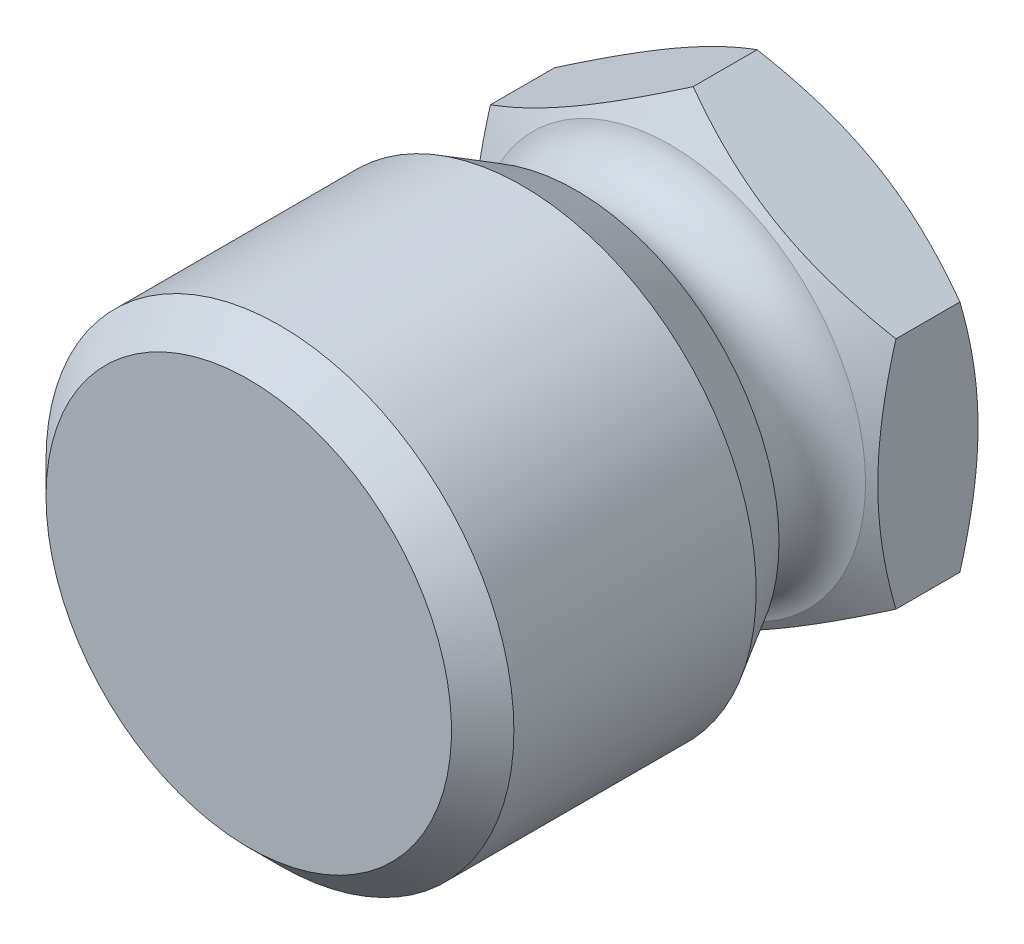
ISO-10303-21;
HEADER;
FILE_DESCRIPTION(('STEP AP214'),'2;1');
FILE_NAME('part.step','',(''),(''),'','','');
FILE_SCHEMA(('AUTOMOTIVE_DESIGN { 1 0 10303 214 1 1 1 1 }'));
ENDSEC;
DATA;
#1=APPLICATION_CONTEXT('core data for automotive mechanical design processes');
#2=APPLICATION_PROTOCOL_DEFINITION('international standard','automotive_design',2000,#1);
#3=PRODUCT_CONTEXT('',#1,'mechanical');
#4=PRODUCT('Part','Part','',(#3));
#5=PRODUCT_RELATED_PRODUCT_CATEGORY('part','',(#4));
#6=PRODUCT_DEFINITION_FORMATION('','',#4);
#7=PRODUCT_DEFINITION_CONTEXT('part definition',#1,'design');
#8=PRODUCT_DEFINITION('design','',#6,#7);
#9=PRODUCT_DEFINITION_SHAPE('','',#8);
#10=(LENGTH_UNIT() NAMED_UNIT(*) SI_UNIT(.MILLI.,.METRE.));
#11=(NAMED_UNIT(*) PLANE_ANGLE_UNIT() SI_UNIT($,.RADIAN.));
#12=(NAMED_UNIT(*) SI_UNIT($,.STERADIAN.) SOLID_ANGLE_UNIT());
#13=UNCERTAINTY_MEASURE_WITH_UNIT(LENGTH_MEASURE(1.E-05),#10,'distance_accuracy_value','');
#14=(GEOMETRIC_REPRESENTATION_CONTEXT(3) GLOBAL_UNCERTAINTY_ASSIGNED_CONTEXT((#13)) GLOBAL_UNIT_ASSIGNED_CONTEXT((#10,
#11,#12)) REPRESENTATION_CONTEXT('',''));
#15=CARTESIAN_POINT('',(0.,0.,0.));
#16=DIRECTION('',(0.,0.,1.));
#17=DIRECTION('',(1.,0.,0.));
#18=AXIS2_PLACEMENT_3D('',#15,#16,#17);
#19=CARTESIAN_POINT('',(0.,0.,3.5));
#20=DIRECTION('',(0.,0.,-1.));
#21=DIRECTION('',(0.,-1.,0.));
#22=AXIS2_PLACEMENT_3D('',#19,#20,#21);
#23=CONICAL_SURFACE('',#22,6.25,1.0471975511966);
#24=CARTESIAN_POINT('',(0.,0.,3.5));
#25=DIRECTION('',(0.,0.,1.));
#26=DIRECTION('',(0.,-1.,0.));
#27=AXIS2_PLACEMENT_3D('',#24,#25,#26);
#28=CIRCLE('',#27,6.25);
#29=CARTESIAN_POINT('',(0.,-6.25,3.5));
#30=VERTEX_POINT('',#29);
#31=EDGE_CURVE('E236',#30,#30,#28,.T.);
#32=ORIENTED_EDGE('',*,*,#31,.F.);
#33=EDGE_LOOP('',(#32));
#34=FACE_BOUND('',#33,.T.);
#35=CARTESIAN_POINT('',(6.5002,3.75266127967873,2.77503918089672));
#36=CARTESIAN_POINT('',(6.35732254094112,3.83515161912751,2.8226580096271));
#37=CARTESIAN_POINT('',(6.21391236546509,3.91794952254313,2.86811573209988));
#38=CARTESIAN_POINT('',(5.92592736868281,4.08421773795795,2.95411375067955));
#39=CARTESIAN_POINT('',(5.78135207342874,4.16768832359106,2.99465192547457));
#40=CARTESIAN_POINT('',(5.34531134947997,4.41943655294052,3.10809143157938));
#41=CARTESIAN_POINT('',(5.05212471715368,4.5887079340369,3.17261462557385));
#42=CARTESIAN_POINT('',(4.61337625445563,4.84201947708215,3.2482758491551));
#43=CARTESIAN_POINT('',(4.46912536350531,4.92530276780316,3.2698295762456));
#44=CARTESIAN_POINT('',(4.17997178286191,5.09224566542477,3.30597211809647));
#45=CARTESIAN_POINT('',(4.03506915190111,5.17590523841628,3.32056154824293));
#46=CARTESIAN_POINT('',(3.74501222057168,5.34336968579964,3.34240368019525));
#47=CARTESIAN_POINT('',(3.59985839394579,5.427174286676,3.34966470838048));
#48=CARTESIAN_POINT('',(3.30942466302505,5.59485627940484,3.35670213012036));
#49=CARTESIAN_POINT('',(3.16414476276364,5.6787336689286,3.35647875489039));
#50=CARTESIAN_POINT('',(2.76612405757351,5.90853103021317,3.34557897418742));
#51=CARTESIAN_POINT('',(2.51351353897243,6.05437578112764,3.32728061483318));
#52=CARTESIAN_POINT('',(2.00997032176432,6.34509659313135,3.26925609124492));
#53=CARTESIAN_POINT('',(1.75903939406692,6.48997163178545,3.22951009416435));
#54=CARTESIAN_POINT('',(1.25448277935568,6.78127752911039,3.13015652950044));
#55=CARTESIAN_POINT('',(1.00092075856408,6.92767163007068,3.07012800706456));
#56=CARTESIAN_POINT('',(0.497578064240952,7.21827667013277,2.93388744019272));
#57=CARTESIAN_POINT('',(0.247790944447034,7.36249133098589,2.857707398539));
#58=CARTESIAN_POINT('',(-0.00020000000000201,7.50566896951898,2.77503918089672));
#59=B_SPLINE_CURVE_WITH_KNOTS('',3,(#35,#36,#37,#38,#39,#40,#41,#42,#43,#44,#45,#46,#47,#48,#49,
#50,#51,#52,#53,#54,#55,#56,#57,#58),.UNSPECIFIED.,.F.,.F.,(4,2,2,2,2,2,2,2,2,2,2,4),(0.,
0.515105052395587,1.03043143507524,2.06322554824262,2.56697389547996,3.07067772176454,
3.57380860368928,4.0769239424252,4.9527935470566,5.82947446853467,6.72559912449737,
7.61996451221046),.UNSPECIFIED.);
#60=CARTESIAN_POINT('',(6.5,3.75277674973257,2.77510584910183));
#61=VERTEX_POINT('',#60);
#62=CARTESIAN_POINT('',(0.,7.50555349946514,2.77510584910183));
#63=VERTEX_POINT('',#62);
#64=EDGE_CURVE('E70',#61,#63,#59,.T.);
#65=ORIENTED_EDGE('',*,*,#64,.T.);
#66=CARTESIAN_POINT('',(0.000199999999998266,7.50566896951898,2.77503918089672));
#67=CARTESIAN_POINT('',(-0.14267745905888,7.4231786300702,2.8226580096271));
#68=CARTESIAN_POINT('',(-0.286087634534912,7.34038072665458,2.86811573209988));
#69=CARTESIAN_POINT('',(-0.574072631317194,7.17411251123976,2.95411375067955));
#70=CARTESIAN_POINT('',(-0.718647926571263,7.09064192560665,2.99465192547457));
#71=CARTESIAN_POINT('',(-1.15468865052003,6.83889369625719,3.10809143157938));
#72=CARTESIAN_POINT('',(-1.44787528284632,6.66962231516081,3.17261462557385));
#73=CARTESIAN_POINT('',(-1.88662374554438,6.41631077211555,3.2482758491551));
#74=CARTESIAN_POINT('',(-2.03087463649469,6.33302748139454,3.26982957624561));
#75=CARTESIAN_POINT('',(-2.32002821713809,6.16608458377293,3.30597211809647));
#76=CARTESIAN_POINT('',(-2.46493084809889,6.08242501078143,3.32056154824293));
#77=CARTESIAN_POINT('',(-2.75498777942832,5.91496056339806,3.34240368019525));
#78=CARTESIAN_POINT('',(-2.90014160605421,5.8311559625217,3.34966470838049));
#79=CARTESIAN_POINT('',(-3.19057533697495,5.66347396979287,3.35670213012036));
#80=CARTESIAN_POINT('',(-3.33585523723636,5.5795965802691,3.35647875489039));
#81=CARTESIAN_POINT('',(-3.7338759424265,5.34979921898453,3.34557897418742));
#82=CARTESIAN_POINT('',(-3.98648646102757,5.20395446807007,3.32728061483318));
#83=CARTESIAN_POINT('',(-4.49002967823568,4.91323365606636,3.26925609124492));
#84=CARTESIAN_POINT('',(-4.74096060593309,4.76835861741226,3.22951009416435));
#85=CARTESIAN_POINT('',(-5.24551722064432,4.47705272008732,3.13015652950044));
#86=CARTESIAN_POINT('',(-5.49907924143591,4.33065861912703,3.07012800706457));
#87=CARTESIAN_POINT('',(-6.00242193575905,4.04005357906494,2.93388744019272));
#88=CARTESIAN_POINT('',(-6.25220905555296,3.89583891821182,2.857707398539));
#89=CARTESIAN_POINT('',(-6.5002,3.75266127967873,2.77503918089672));
#90=B_SPLINE_CURVE_WITH_KNOTS('',3,(#66,#67,#68,#69,#70,#71,#72,#73,#74,#75,#76,#77,#78,#79,#80,
#81,#82,#83,#84,#85,#86,#87,#88,#89),.UNSPECIFIED.,.F.,.F.,(4,2,2,2,2,2,2,2,2,2,2,4),(0.,
0.515105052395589,1.03043143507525,2.06322554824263,2.56697389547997,3.07067772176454,
3.57380860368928,4.07692394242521,4.95279354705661,5.82947446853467,6.72559912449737,
7.61996451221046),.UNSPECIFIED.);
#91=CARTESIAN_POINT('',(-6.5,3.75277674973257,2.77510584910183));
#92=VERTEX_POINT('',#91);
#93=EDGE_CURVE('E182',#63,#92,#90,.T.);
#94=ORIENTED_EDGE('',*,*,#93,.T.);
#95=CARTESIAN_POINT('',(-6.5,-10.0803059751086,0.183542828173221));
#96=CARTESIAN_POINT('',(-6.5,-9.79640798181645,0.321258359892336));
#97=CARTESIAN_POINT('',(-6.5,-9.51185826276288,0.457653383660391));
#98=CARTESIAN_POINT('',(-6.5,-8.94110879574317,0.7270597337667));
#99=CARTESIAN_POINT('',(-6.5,-8.6549087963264,0.8600705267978));
#100=CARTESIAN_POINT('',(-6.5,-8.07903757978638,1.12263491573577));
#101=CARTESIAN_POINT('',(-6.5,-7.7893559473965,1.25216574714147));
#102=CARTESIAN_POINT('',(-6.5,-7.2076885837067,1.50592640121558));
#103=CARTESIAN_POINT('',(-6.5,-6.91570296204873,1.63015647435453));
#104=CARTESIAN_POINT('',(-6.5,-6.31954132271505,1.87579840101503));
#105=CARTESIAN_POINT('',(-6.5,-6.0152748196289,1.99699184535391));
#106=CARTESIAN_POINT('',(-6.5,-5.4031817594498,2.23020600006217));
#107=CARTESIAN_POINT('',(-6.5,-5.09535480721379,2.34222568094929));
#108=CARTESIAN_POINT('',(-6.5,-4.47622849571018,2.55415186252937));
#109=CARTESIAN_POINT('',(-6.5,-4.16493761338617,2.65408288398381));
#110=CARTESIAN_POINT('',(-6.5,-3.5378872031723,2.83862388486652));
#111=CARTESIAN_POINT('',(-6.5,-3.22212911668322,2.92323868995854));
#112=CARTESIAN_POINT('',(-6.5,-2.58773233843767,3.07264040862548));
#113=CARTESIAN_POINT('',(-6.5,-2.26911936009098,3.13753476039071));
#114=CARTESIAN_POINT('',(-6.5,-1.62788618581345,3.24381230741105));
#115=CARTESIAN_POINT('',(-6.5,-1.30526637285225,3.28519773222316));
#116=CARTESIAN_POINT('',(-6.5,-0.821760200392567,3.32689634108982));
#117=CARTESIAN_POINT('',(-6.5,-0.661712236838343,3.33739555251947));
#118=CARTESIAN_POINT('',(-6.5,-0.341308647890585,3.35162231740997));
#119=CARTESIAN_POINT('',(-6.5,-0.1809530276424,3.35534998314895));
#120=CARTESIAN_POINT('',(-6.5,0.139770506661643,3.35593722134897));
#121=CARTESIAN_POINT('',(-6.5,0.300138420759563,3.35279676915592));
#122=CARTESIAN_POINT('',(-6.5,0.620599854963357,3.33972649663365));
#123=CARTESIAN_POINT('',(-6.5,0.780693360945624,3.32979633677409));
#124=CARTESIAN_POINT('',(-6.5,1.1654456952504,3.29798160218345));
#125=CARTESIAN_POINT('',(-6.5,1.3898436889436,3.27287534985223));
#126=CARTESIAN_POINT('',(-6.5,1.8369636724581,3.21069225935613));
#127=CARTESIAN_POINT('',(-6.5,2.05968543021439,3.17361379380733));
#128=CARTESIAN_POINT('',(-6.5,2.72508734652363,3.04638697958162));
#129=CARTESIAN_POINT('',(-6.5,3.1647541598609,2.94027061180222));
#130=CARTESIAN_POINT('',(-6.5,3.82217845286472,2.75638328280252));
#131=CARTESIAN_POINT('',(-6.5,4.04334906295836,2.69011409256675));
#132=CARTESIAN_POINT('',(-6.5,4.48354187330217,2.5507245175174));
#133=CARTESIAN_POINT('',(-6.5,4.70256405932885,2.47760408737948));
#134=CARTESIAN_POINT('',(-6.5,5.13852957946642,2.32568261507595));
#135=CARTESIAN_POINT('',(-6.5,5.3554735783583,2.24688346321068));
#136=CARTESIAN_POINT('',(-6.5,5.78756618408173,2.08452854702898));
#137=CARTESIAN_POINT('',(-6.5,6.00271481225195,2.00097283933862));
#138=CARTESIAN_POINT('',(-6.5,6.51173399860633,1.79784389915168));
#139=CARTESIAN_POINT('',(-6.5,6.80489861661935,1.67650489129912));
#140=CARTESIAN_POINT('',(-6.5,7.38872610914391,1.42793325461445));
#141=CARTESIAN_POINT('',(-6.5,7.67938882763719,1.30070026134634));
#142=CARTESIAN_POINT('',(-6.5,8.25867489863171,1.04152898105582));
#143=CARTESIAN_POINT('',(-6.5,8.54729781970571,0.909589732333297));
#144=CARTESIAN_POINT('',(-6.5,9.12279833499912,0.641951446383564));
#145=CARTESIAN_POINT('',(-6.5,9.40967589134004,0.506252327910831));
#146=CARTESIAN_POINT('',(-6.5,9.98227600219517,0.231657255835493));
#147=CARTESIAN_POINT('',(-6.5,10.267996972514,0.0927580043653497));
#148=CARTESIAN_POINT('',(-6.5,10.8382059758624,-0.187550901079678));
#149=CARTESIAN_POINT('',(-6.5,11.1226939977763,-0.328960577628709));
#150=CARTESIAN_POINT('',(-6.5,11.9745275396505,-0.756246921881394));
#151=CARTESIAN_POINT('',(-6.5,12.5403203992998,-1.04521855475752));
#152=CARTESIAN_POINT('',(-6.5,13.6212920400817,-1.60433379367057));
#153=CARTESIAN_POINT('',(-6.5,14.1367140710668,-1.87400921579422));
#154=CARTESIAN_POINT('',(-6.5,15.1656468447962,-2.41702383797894));
#155=CARTESIAN_POINT('',(-6.5,15.6791575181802,-2.69036316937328));
#156=CARTESIAN_POINT('',(-6.5,16.7033992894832,-3.23913932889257));
#157=CARTESIAN_POINT('',(-6.5,17.2141341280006,-3.51456918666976));
#158=CARTESIAN_POINT('',(-6.5,18.2343827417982,-4.06761472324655));
#159=CARTESIAN_POINT('',(-6.5,18.7438965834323,-4.34523027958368));
#160=CARTESIAN_POINT('',(-6.5,19.2529615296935,-4.62366105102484));
#161=B_SPLINE_CURVE_WITH_KNOTS('',3,(#95,#96,#97,#98,#99,#100,#101,#102,#103,#104,#105,#106,
#107,#108,#109,#110,#111,#112,#113,#114,#115,#116,#117,#118,#119,#120,#121,#122,#123,#124,#125,
#126,#127,#128,#129,#130,#131,#132,#133,#134,#135,#136,#137,#138,#139,#140,#141,#142,#143,#144,
#145,#146,#147,#148,#149,#150,#151,#152,#153,#154,#155,#156,#157,#158,#159,#160),.UNSPECIFIED.,
.F.,.F.,(4,2,2,2,2,2,2,2,2,2,2,2,2,2,2,2,2,2,2,2,2,2,2,2,2,2,2,2,2,2,2,2,4),(0.,
0.946622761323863,1.89339378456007,2.84531931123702,3.79719980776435,4.7796300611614,
5.76217041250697,6.74268310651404,7.72288633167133,8.69764944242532,9.67232009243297,
10.1533745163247,10.6344209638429,11.1154691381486,11.5965413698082,12.273553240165,
12.9506571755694,14.3056149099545,14.9982134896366,15.690816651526,16.3831903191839,
17.0755557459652,18.0273182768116,18.9791397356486,19.9311568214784,20.8831944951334,
21.8362615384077,22.7893371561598,24.6952289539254,26.4403385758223,28.1855109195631,
29.9263111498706,31.6670145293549),.UNSPECIFIED.);
#162=CARTESIAN_POINT('',(-6.5,-3.75277674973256,2.77510584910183));
#163=VERTEX_POINT('',#162);
#164=EDGE_CURVE('E175',#92,#163,#161,.F.);
#165=ORIENTED_EDGE('',*,*,#164,.T.);
#166=CARTESIAN_POINT('',(-6.5002,-3.75266127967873,2.77503918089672));
#167=CARTESIAN_POINT('',(-6.35732254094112,-3.83515161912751,2.8226580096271));
#168=CARTESIAN_POINT('',(-6.21391236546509,-3.91794952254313,2.86811573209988));
#169=CARTESIAN_POINT('',(-5.92592736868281,-4.08421773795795,2.95411375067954));
#170=CARTESIAN_POINT('',(-5.78135207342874,-4.16768832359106,2.99465192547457));
#171=CARTESIAN_POINT('',(-5.34531134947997,-4.41943655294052,3.10809143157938));
#172=CARTESIAN_POINT('',(-5.05212471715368,-4.5887079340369,3.17261462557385));
#173=CARTESIAN_POINT('',(-4.61337625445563,-4.84201947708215,3.2482758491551));
#174=CARTESIAN_POINT('',(-4.46912536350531,-4.92530276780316,3.2698295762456));
#175=CARTESIAN_POINT('',(-4.17997178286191,-5.09224566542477,3.30597211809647));
#176=CARTESIAN_POINT('',(-4.03506915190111,-5.17590523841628,3.32056154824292));
#177=CARTESIAN_POINT('',(-3.74501222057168,-5.34336968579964,3.34240368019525));
#178=CARTESIAN_POINT('',(-3.59985839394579,-5.427174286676,3.34966470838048));
#179=CARTESIAN_POINT('',(-3.30942466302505,-5.59485627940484,3.35670213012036));
#180=CARTESIAN_POINT('',(-3.16414476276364,-5.6787336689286,3.35647875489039));
#181=CARTESIAN_POINT('',(-2.76612405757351,-5.90853103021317,3.34557897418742));
#182=CARTESIAN_POINT('',(-2.51351353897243,-6.05437578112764,3.32728061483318));
#183=CARTESIAN_POINT('',(-2.00997032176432,-6.34509659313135,3.26925609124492));
#184=CARTESIAN_POINT('',(-1.75903939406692,-6.48997163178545,3.22951009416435));
#185=CARTESIAN_POINT('',(-1.25448277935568,-6.78127752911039,3.13015652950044));
#186=CARTESIAN_POINT('',(-1.00092075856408,-6.92767163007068,3.07012800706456));
#187=CARTESIAN_POINT('',(-0.497578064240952,-7.21827667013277,2.93388744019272));
#188=CARTESIAN_POINT('',(-0.247790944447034,-7.36249133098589,2.857707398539));
#189=CARTESIAN_POINT('',(0.000200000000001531,-7.50566896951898,2.77503918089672));
#190=B_SPLINE_CURVE_WITH_KNOTS('',3,(#166,#167,#168,#169,#170,#171,#172,#173,#174,#175,#176,
#177,#178,#179,#180,#181,#182,#183,#184,#185,#186,#187,#188,#189),.UNSPECIFIED.,.F.,.F.,(4,2,2,
2,2,2,2,2,2,2,2,4),(0.,0.515105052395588,1.03043143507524,2.06322554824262,2.56697389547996,
3.07067772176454,3.57380860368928,4.0769239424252,4.9527935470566,5.82947446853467,
6.72559912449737,7.61996451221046),.UNSPECIFIED.);
#191=CARTESIAN_POINT('',(0.,-7.50555349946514,2.77510584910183));
#192=VERTEX_POINT('',#191);
#193=EDGE_CURVE('E91',#163,#192,#190,.T.);
#194=ORIENTED_EDGE('',*,*,#193,.T.);
#195=CARTESIAN_POINT('',(-0.000199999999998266,-7.50566896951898,2.77503918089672));
#196=CARTESIAN_POINT('',(0.142677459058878,-7.4231786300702,2.82265800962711));
#197=CARTESIAN_POINT('',(0.286087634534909,-7.34038072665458,2.86811573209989));
#198=CARTESIAN_POINT('',(0.574072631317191,-7.17411251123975,2.95411375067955));
#199=CARTESIAN_POINT('',(0.718647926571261,-7.09064192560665,2.99465192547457));
#200=CARTESIAN_POINT('',(1.15468865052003,-6.83889369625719,3.10809143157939));
#201=CARTESIAN_POINT('',(1.44787528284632,-6.6696223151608,3.17261462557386));
#202=CARTESIAN_POINT('',(1.88662374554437,-6.41631077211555,3.2482758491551));
#203=CARTESIAN_POINT('',(2.03087463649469,-6.33302748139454,3.26982957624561));
#204=CARTESIAN_POINT('',(2.32002821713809,-6.16608458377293,3.30597211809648));
#205=CARTESIAN_POINT('',(2.46493084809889,-6.08242501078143,3.32056154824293));
#206=CARTESIAN_POINT('',(2.75498777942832,-5.91496056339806,3.34240368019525));
#207=CARTESIAN_POINT('',(2.90014160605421,-5.8311559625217,3.34966470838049));
#208=CARTESIAN_POINT('',(3.19057533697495,-5.66347396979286,3.35670213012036));
#209=CARTESIAN_POINT('',(3.33585523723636,-5.5795965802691,3.35647875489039));
#210=CARTESIAN_POINT('',(3.7338759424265,-5.34979921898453,3.34557897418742));
#211=CARTESIAN_POINT('',(3.98648646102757,-5.20395446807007,3.32728061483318));
#212=CARTESIAN_POINT('',(4.49002967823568,-4.91323365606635,3.26925609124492));
#213=CARTESIAN_POINT('',(4.74096060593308,-4.76835861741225,3.22951009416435));
#214=CARTESIAN_POINT('',(5.24551722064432,-4.47705272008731,3.13015652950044));
#215=CARTESIAN_POINT('',(5.49907924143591,-4.33065861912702,3.07012800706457));
#216=CARTESIAN_POINT('',(6.00242193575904,-4.04005357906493,2.93388744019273));
#217=CARTESIAN_POINT('',(6.25220905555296,-3.89583891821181,2.857707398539));
#218=CARTESIAN_POINT('',(6.5002,-3.75266127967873,2.77503918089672));
#219=B_SPLINE_CURVE_WITH_KNOTS('',3,(#195,#196,#197,#198,#199,#200,#201,#202,#203,#204,#205,
#206,#207,#208,#209,#210,#211,#212,#213,#214,#215,#216,#217,#218),.UNSPECIFIED.,.F.,.F.,(4,2,2,
2,2,2,2,2,2,2,2,4),(0.,0.515105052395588,1.03043143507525,2.06322554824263,2.56697389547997,
3.07067772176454,3.57380860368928,4.07692394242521,4.95279354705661,5.82947446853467,
6.72559912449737,7.61996451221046),.UNSPECIFIED.);
#220=CARTESIAN_POINT('',(6.5,-3.75277674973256,2.77510584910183));
#221=VERTEX_POINT('',#220);
#222=EDGE_CURVE('E89',#192,#221,#219,.T.);
#223=ORIENTED_EDGE('',*,*,#222,.T.);
#224=CARTESIAN_POINT('',(6.5,-10.0803059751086,0.183542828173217));
#225=CARTESIAN_POINT('',(6.5,-9.79640798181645,0.321258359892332));
#226=CARTESIAN_POINT('',(6.5,-9.51185826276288,0.457653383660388));
#227=CARTESIAN_POINT('',(6.5,-8.94110879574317,0.727059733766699));
#228=CARTESIAN_POINT('',(6.5,-8.6549087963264,0.8600705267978));
#229=CARTESIAN_POINT('',(6.5,-8.07903757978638,1.12263491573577));
#230=CARTESIAN_POINT('',(6.5,-7.7893559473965,1.25216574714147));
#231=CARTESIAN_POINT('',(6.5,-7.2076885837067,1.50592640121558));
#232=CARTESIAN_POINT('',(6.5,-6.91570296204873,1.63015647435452));
#233=CARTESIAN_POINT('',(6.5,-6.31954132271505,1.87579840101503));
#234=CARTESIAN_POINT('',(6.5,-6.0152748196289,1.99699184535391));
#235=CARTESIAN_POINT('',(6.5,-5.4031817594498,2.23020600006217));
#236=CARTESIAN_POINT('',(6.5,-5.09535480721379,2.34222568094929));
#237=CARTESIAN_POINT('',(6.5,-4.47622849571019,2.55415186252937));
#238=CARTESIAN_POINT('',(6.5,-4.16493761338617,2.65408288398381));
#239=CARTESIAN_POINT('',(6.5,-3.5378872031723,2.83862388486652));
#240=CARTESIAN_POINT('',(6.5,-3.22212911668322,2.92323868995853));
#241=CARTESIAN_POINT('',(6.5,-2.58773233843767,3.07264040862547));
#242=CARTESIAN_POINT('',(6.5,-2.26911936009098,3.13753476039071));
#243=CARTESIAN_POINT('',(6.5,-1.62788618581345,3.24381230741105));
#244=CARTESIAN_POINT('',(6.5,-1.30526637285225,3.28519773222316));
#245=CARTESIAN_POINT('',(6.5,-0.821760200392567,3.32689634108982));
#246=CARTESIAN_POINT('',(6.5,-0.661712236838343,3.33739555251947));
#247=CARTESIAN_POINT('',(6.5,-0.341308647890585,3.35162231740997));
#248=CARTESIAN_POINT('',(6.5,-0.1809530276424,3.35534998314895));
#249=CARTESIAN_POINT('',(6.5,0.139770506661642,3.35593722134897));
#250=CARTESIAN_POINT('',(6.5,0.300138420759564,3.35279676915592));
#251=CARTESIAN_POINT('',(6.5,0.620599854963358,3.33972649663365));
#252=CARTESIAN_POINT('',(6.5,0.780693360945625,3.32979633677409));
#253=CARTESIAN_POINT('',(6.5,1.1654456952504,3.29798160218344));
#254=CARTESIAN_POINT('',(6.5,1.3898436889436,3.27287534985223));
#255=CARTESIAN_POINT('',(6.5,1.8369636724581,3.21069225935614));
#256=CARTESIAN_POINT('',(6.5,2.05968543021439,3.17361379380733));
#257=CARTESIAN_POINT('',(6.5,2.72508734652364,3.04638697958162));
#258=CARTESIAN_POINT('',(6.5,3.1647541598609,2.94027061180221));
#259=CARTESIAN_POINT('',(6.5,3.82217845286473,2.75638328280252));
#260=CARTESIAN_POINT('',(6.5,4.04334906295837,2.69011409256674));
#261=CARTESIAN_POINT('',(6.5,4.48354187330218,2.5507245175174));
#262=CARTESIAN_POINT('',(6.5,4.70256405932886,2.47760408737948));
#263=CARTESIAN_POINT('',(6.5,5.13852957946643,2.32568261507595));
#264=CARTESIAN_POINT('',(6.5,5.3554735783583,2.24688346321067));
#265=CARTESIAN_POINT('',(6.5,5.78756618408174,2.08452854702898));
#266=CARTESIAN_POINT('',(6.5,6.00271481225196,2.00097283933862));
#267=CARTESIAN_POINT('',(6.5,6.51173399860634,1.79784389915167));
#268=CARTESIAN_POINT('',(6.5,6.80489861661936,1.67650489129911));
#269=CARTESIAN_POINT('',(6.5,7.38872610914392,1.42793325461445));
#270=CARTESIAN_POINT('',(6.5,7.67938882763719,1.30070026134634));
#271=CARTESIAN_POINT('',(6.5,8.25867489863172,1.04152898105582));
#272=CARTESIAN_POINT('',(6.5,8.54729781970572,0.909589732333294));
#273=CARTESIAN_POINT('',(6.5,9.12279833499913,0.641951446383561));
#274=CARTESIAN_POINT('',(6.5,9.40967589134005,0.50625232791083));
#275=CARTESIAN_POINT('',(6.5,9.98227600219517,0.231657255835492));
#276=CARTESIAN_POINT('',(6.5,10.267996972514,0.0927580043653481));
#277=CARTESIAN_POINT('',(6.5,10.8382059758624,-0.18755090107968));
#278=CARTESIAN_POINT('',(6.5,11.1226939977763,-0.328960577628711));
#279=CARTESIAN_POINT('',(6.5,11.9745275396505,-0.756246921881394));
#280=CARTESIAN_POINT('',(6.5,12.5403203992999,-1.04521855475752));
#281=CARTESIAN_POINT('',(6.5,13.6212920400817,-1.60433379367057));
#282=CARTESIAN_POINT('',(6.5,14.1367140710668,-1.87400921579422));
#283=CARTESIAN_POINT('',(6.5,15.1656468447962,-2.41702383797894));
#284=CARTESIAN_POINT('',(6.5,15.6791575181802,-2.69036316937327));
#285=CARTESIAN_POINT('',(6.5,16.7033992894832,-3.23913932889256));
#286=CARTESIAN_POINT('',(6.5,17.2141341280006,-3.51456918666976));
#287=CARTESIAN_POINT('',(6.5,18.2343827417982,-4.06761472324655));
#288=CARTESIAN_POINT('',(6.5,18.7438965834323,-4.34523027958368));
#289=CARTESIAN_POINT('',(6.5,19.2529615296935,-4.62366105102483));
#290=B_SPLINE_CURVE_WITH_KNOTS('',3,(#224,#225,#226,#227,#228,#229,#230,#231,#232,#233,#234,
#235,#236,#237,#238,#239,#240,#241,#242,#243,#244,#245,#246,#247,#248,#249,#250,#251,#252,#253,
#254,#255,#256,#257,#258,#259,#260,#261,#262,#263,#264,#265,#266,#267,#268,#269,#270,#271,#272,
#273,#274,#275,#276,#277,#278,#279,#280,#281,#282,#283,#284,#285,#286,#287,#288,#289),
.UNSPECIFIED.,.F.,.F.,(4,2,2,2,2,2,2,2,2,2,2,2,2,2,2,2,2,2,2,2,2,2,2,2,2,2,2,2,2,2,2,2,4),(0.,
0.946622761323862,1.89339378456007,2.84531931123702,3.79719980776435,4.7796300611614,
5.76217041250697,6.74268310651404,7.72288633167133,8.69764944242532,9.67232009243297,
10.1533745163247,10.6344209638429,11.1154691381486,11.5965413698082,12.273553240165,
12.9506571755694,14.3056149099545,14.9982134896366,15.690816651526,16.3831903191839,
17.0755557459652,18.0273182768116,18.9791397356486,19.9311568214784,20.8831944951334,
21.8362615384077,22.7893371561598,24.6952289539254,26.4403385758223,28.1855109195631,
29.9263111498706,31.6670145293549),.UNSPECIFIED.);
#291=EDGE_CURVE('E75',#221,#61,#290,.T.);
#292=ORIENTED_EDGE('',*,*,#291,.T.);
#293=EDGE_LOOP('',(#65,#94,#165,#194,#223,#292));
#294=FACE_BOUND('',#293,.T.);
#295=ADVANCED_FACE('F14',(#34,#294),#23,.T.);
#296=CARTESIAN_POINT('',(-5.95,0.,6.5238050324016));
#297=DIRECTION('',(0.,0.,1.));
#298=DIRECTION('',(1.,0.,0.));
#299=AXIS2_PLACEMENT_3D('',#296,#297,#298);
#300=PLANE('',#299);
#301=CARTESIAN_POINT('',(0.,0.,6.5238050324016));
#302=DIRECTION('',(0.,0.,1.));
#303=DIRECTION('',(1.,0.,0.));
#304=AXIS2_PLACEMENT_3D('',#301,#302,#303);
#305=CIRCLE('',#304,6.5);
#306=CARTESIAN_POINT('',(6.5,0.,6.5238050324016));
#307=VERTEX_POINT('',#306);
#308=EDGE_CURVE('E268',#307,#307,#305,.T.);
#309=ORIENTED_EDGE('',*,*,#308,.F.);
#310=EDGE_LOOP('',(#309));
#311=FACE_BOUND('',#310,.T.);
#312=CARTESIAN_POINT('',(0.,0.,6.5238050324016));
#313=DIRECTION('',(0.,0.,1.));
#314=DIRECTION('',(0.,-1.,0.));
#315=AXIS2_PLACEMENT_3D('',#312,#313,#314);
#316=CIRCLE('',#315,5.66521433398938);
#317=CARTESIAN_POINT('',(0.,-5.66521433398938,6.5238050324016));
#318=VERTEX_POINT('',#317);
#319=EDGE_CURVE('E249',#318,#318,#316,.F.);
#320=ORIENTED_EDGE('',*,*,#319,.F.);
#321=EDGE_LOOP('',(#320));
#322=FACE_BOUND('',#321,.T.);
#323=ADVANCED_FACE('F214',(#311,#322),#300,.F.);
#324=CARTESIAN_POINT('',(-7.5,0.,17.0238050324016));
#325=DIRECTION('',(0.,0.,-1.));
#326=DIRECTION('',(-1.,0.,0.));
#327=AXIS2_PLACEMENT_3D('',#324,#325,#326);
#328=PLANE('',#327);
#329=CARTESIAN_POINT('',(0.,0.,17.0238050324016));
#330=DIRECTION('',(0.,0.,-1.));
#331=DIRECTION('',(-1.,0.,0.));
#332=AXIS2_PLACEMENT_3D('',#329,#330,#331);
#333=CIRCLE('',#332,6.5);
#334=CARTESIAN_POINT('',(-6.5,0.,17.0238050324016));
#335=VERTEX_POINT('',#334);
#336=EDGE_CURVE('E265',#335,#335,#333,.F.);
#337=ORIENTED_EDGE('',*,*,#336,.T.);
#338=EDGE_LOOP('',(#337));
#339=FACE_BOUND('',#338,.T.);
#340=ADVANCED_FACE('F212',(#339),#328,.F.);
#341=CARTESIAN_POINT('',(0.,0.,6.5238050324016));
#342=DIRECTION('',(0.,0.,1.));
#343=DIRECTION('',(1.,0.,0.));
#344=AXIS2_PLACEMENT_3D('',#341,#342,#343);
#345=CONICAL_SURFACE('',#344,6.5,0.523598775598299);
#346=CARTESIAN_POINT('',(0.,0.,8.25585583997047));
#347=DIRECTION('',(0.,0.,1.));
#348=DIRECTION('',(1.,0.,0.));
#349=AXIS2_PLACEMENT_3D('',#346,#347,#348);
#350=CIRCLE('',#349,7.5);
#351=CARTESIAN_POINT('',(7.5,0.,8.25585583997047));
#352=VERTEX_POINT('',#351);
#353=EDGE_CURVE('E242',#352,#352,#350,.T.);
#354=ORIENTED_EDGE('',*,*,#353,.F.);
#355=EDGE_LOOP('',(#354));
#356=FACE_BOUND('',#355,.T.);
#357=ORIENTED_EDGE('',*,*,#308,.T.);
#358=EDGE_LOOP('',(#357));
#359=FACE_BOUND('',#358,.T.);
#360=ADVANCED_FACE('F208',(#356,#359),#345,.T.);
#361=CARTESIAN_POINT('',(0.,0.,17.0238050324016));
#362=DIRECTION('',(0.,0.,1.));
#363=DIRECTION('',(1.,0.,0.));
#364=AXIS2_PLACEMENT_3D('',#361,#362,#363);
#365=CYLINDRICAL_SURFACE('',#364,7.5);
#366=CARTESIAN_POINT('',(0.,0.,16.0238050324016));
#367=DIRECTION('',(0.,0.,-1.));
#368=DIRECTION('',(-1.,0.,0.));
#369=AXIS2_PLACEMENT_3D('',#366,#367,#368);
#370=CIRCLE('',#369,7.5);
#371=CARTESIAN_POINT('',(-7.5,0.,16.0238050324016));
#372=VERTEX_POINT('',#371);
#373=EDGE_CURVE('E251',#372,#372,#370,.T.);
#374=ORIENTED_EDGE('',*,*,#373,.T.);
#375=EDGE_LOOP('',(#374));
#376=FACE_BOUND('',#375,.T.);
#377=ORIENTED_EDGE('',*,*,#353,.T.);
#378=EDGE_LOOP('',(#377));
#379=FACE_BOUND('',#378,.T.);
#380=ADVANCED_FACE('F205',(#376,#379),#365,.T.);
#381=CARTESIAN_POINT('',(0.,0.,17.0238050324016));
#382=DIRECTION('',(0.,0.,-1.));
#383=DIRECTION('',(-1.,0.,0.));
#384=AXIS2_PLACEMENT_3D('',#381,#382,#383);
#385=CONICAL_SURFACE('',#384,6.5,0.785398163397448);
#386=ORIENTED_EDGE('',*,*,#373,.F.);
#387=EDGE_LOOP('',(#386));
#388=FACE_BOUND('',#387,.T.);
#389=ORIENTED_EDGE('',*,*,#336,.F.);
#390=EDGE_LOOP('',(#389));
#391=FACE_BOUND('',#390,.T.);
#392=ADVANCED_FACE('F195',(#388,#391),#385,.T.);
#393=CARTESIAN_POINT('',(0.,0.,8.5));
#394=DIRECTION('',(0.,0.,-1.));
#395=DIRECTION('',(0.,-1.,0.));
#396=AXIS2_PLACEMENT_3D('',#393,#394,#395);
#397=SPHERICAL_SURFACE('',#396,6.);
#398=CARTESIAN_POINT('',(0.,0.,5.66493944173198));
#399=DIRECTION('',(0.,0.,1.));
#400=DIRECTION('',(0.,-1.,0.));
#401=AXIS2_PLACEMENT_3D('',#398,#399,#400);
#402=CIRCLE('',#401,5.28795155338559);
#403=CARTESIAN_POINT('',(0.,-5.28795155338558,5.66493944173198));
#404=VERTEX_POINT('',#403);
#405=EDGE_CURVE('E238',#404,#404,#402,.T.);
#406=CARTESIAN_POINT('',(0.,-5.28795155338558,5.66493944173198));
#407=CARTESIAN_POINT('',(0.,-5.29257343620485,5.67356017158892));
#408=CARTESIAN_POINT('',(0.,-5.29717423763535,5.68219220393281));
#409=CARTESIAN_POINT('',(0.,-5.30633356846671,5.69947866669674));
#410=CARTESIAN_POINT('',(0.,-5.31089209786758,5.70813309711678));
#411=CARTESIAN_POINT('',(0.,-5.31996677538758,5.72546414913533));
#412=CARTESIAN_POINT('',(0.,-5.32448292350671,5.73414077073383));
#413=CARTESIAN_POINT('',(0.,-5.33347273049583,5.75151599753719));
#414=CARTESIAN_POINT('',(0.,-5.33794638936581,5.76021460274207));
#415=CARTESIAN_POINT('',(0.,-5.34685111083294,5.77763358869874));
#416=CARTESIAN_POINT('',(0.,-5.35128217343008,5.78635396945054));
#417=CARTESIAN_POINT('',(0.,-5.36010159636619,5.80381629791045));
#418=CARTESIAN_POINT('',(0.,-5.36448995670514,5.81255824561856));
#419=CARTESIAN_POINT('',(0.,-5.37322387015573,5.83006349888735));
#420=CARTESIAN_POINT('',(0.,-5.37756942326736,5.83882680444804));
#421=CARTESIAN_POINT('',(0.,-5.38621761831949,5.85637456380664));
#422=CARTESIAN_POINT('',(0.,-5.39052026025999,5.86515901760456));
#423=CARTESIAN_POINT('',(0.,-5.39908253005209,5.88274886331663));
#424=CARTESIAN_POINT('',(0.,-5.4033421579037,5.89155425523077));
#425=CARTESIAN_POINT('',(0.,-5.41181829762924,5.90918576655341));
#426=CARTESIAN_POINT('',(0.,-5.41603480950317,5.9180118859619));
#427=CARTESIAN_POINT('',(0.,-5.42442461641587,5.93568464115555));
#428=CARTESIAN_POINT('',(0.,-5.42859791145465,5.94453127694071));
#429=CARTESIAN_POINT('',(0.,-5.43690118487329,5.96224485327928));
#430=CARTESIAN_POINT('',(0.,-5.44103116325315,5.97111179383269));
#431=CARTESIAN_POINT('',(0.,-5.44924770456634,5.98886576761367));
#432=CARTESIAN_POINT('',(0.,-5.45333426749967,5.99775280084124));
#433=CARTESIAN_POINT('',(0.,-5.46146388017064,6.01554674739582));
#434=CARTESIAN_POINT('',(0.,-5.46550692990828,6.02445366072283));
#435=CARTESIAN_POINT('',(0.,-5.47354941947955,6.04228715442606));
#436=CARTESIAN_POINT('',(0.,-5.47754885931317,6.05121373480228));
#437=CARTESIAN_POINT('',(0.,-5.48550403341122,6.06908634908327));
#438=CARTESIAN_POINT('',(0.,-5.48945976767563,6.07803238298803));
#439=CARTESIAN_POINT('',(0.,-5.49732743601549,6.09594369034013));
#440=CARTESIAN_POINT('',(0.,-5.50123937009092,6.10490896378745));
#441=CARTESIAN_POINT('',(0.,-5.50901934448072,6.12285853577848));
#442=CARTESIAN_POINT('',(0.,-5.51288738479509,6.13184283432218));
#443=CARTESIAN_POINT('',(0.,-5.52057947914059,6.1498302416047));
#444=CARTESIAN_POINT('',(0.,-5.52440353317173,6.15883335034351));
#445=CARTESIAN_POINT('',(0.,-5.53200756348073,6.17685816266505));
#446=CARTESIAN_POINT('',(0.,-5.53578753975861,6.18587986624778));
#447=CARTESIAN_POINT('',(0.,-5.54330332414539,6.20394165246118));
#448=CARTESIAN_POINT('',(0.,-5.5470391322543,6.21298173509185));
#449=CARTESIAN_POINT('',(0.,-5.55446649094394,6.23108006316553));
#450=CARTESIAN_POINT('',(0.,-5.55815804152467,6.24013830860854));
#451=CARTESIAN_POINT('',(0.,-5.56549679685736,6.25827274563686));
#452=CARTESIAN_POINT('',(0.,-5.56914400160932,6.26734893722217));
#453=CARTESIAN_POINT('',(0.,-5.57639397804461,6.28551904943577));
#454=CARTESIAN_POINT('',(0.,-5.57999674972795,6.29461297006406));
#455=CARTESIAN_POINT('',(0.,-5.58715777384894,6.31281832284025));
#456=CARTESIAN_POINT('',(0.,-5.5907160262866,6.32192975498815));
#457=CARTESIAN_POINT('',(0.,-5.59778792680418,6.34016991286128));
#458=CARTESIAN_POINT('',(0.,-5.6013015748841,6.3492986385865));
#459=CARTESIAN_POINT('',(0.,-5.60828418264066,6.36757316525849));
#460=CARTESIAN_POINT('',(0.,-5.6117531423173,6.37671896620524));
#461=CARTESIAN_POINT('',(0.,-5.61864629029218,6.39502742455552));
#462=CARTESIAN_POINT('',(0.,-5.62207047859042,6.40419008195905));
#463=CARTESIAN_POINT('',(0.,-5.62887400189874,6.42253203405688));
#464=CARTESIAN_POINT('',(0.,-5.63225333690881,6.43171132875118));
#465=CARTESIAN_POINT('',(0.,-5.63896707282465,6.45008633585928));
#466=CARTESIAN_POINT('',(0.,-5.64230147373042,6.45928204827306));
#467=CARTESIAN_POINT('',(0.,-5.64892526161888,6.47768967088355));
#468=CARTESIAN_POINT('',(0.,-5.65221464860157,6.48690158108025));
#469=CARTESIAN_POINT('',(0.,-5.65874833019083,6.50534137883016));
#470=CARTESIAN_POINT('',(0.,-5.6619926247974,6.51456926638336));
#471=CARTESIAN_POINT('',(0.,-5.66521433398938,6.5238050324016));
#472=B_SPLINE_CURVE_WITH_KNOTS('',3,(#406,#407,#408,#409,#410,#411,#412,#413,#414,#415,#416,
#417,#418,#419,#420,#421,#422,#423,#424,#425,#426,#427,#428,#429,#430,#431,#432,#433,#434,#435,
#436,#437,#438,#439,#440,#441,#442,#443,#444,#445,#446,#447,#448,#449,#450,#451,#452,#453,#454,
#455,#456,#457,#458,#459,#460,#461,#462,#463,#464,#465,#466,#467,#468,#469,#470,#471),
.UNSPECIFIED.,.F.,.F.,(4,2,2,2,2,2,2,2,2,2,2,2,2,2,2,2,2,2,2,2,2,2,2,2,2,2,2,2,2,2,2,2,4),(0.,
0.029344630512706,0.0586892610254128,0.0880338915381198,0.117378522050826,0.146723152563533,
0.176067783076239,0.205412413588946,0.234757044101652,0.264101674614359,0.293446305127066,
0.322790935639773,0.352135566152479,0.381480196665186,0.410824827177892,0.440169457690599,
0.469514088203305,0.498858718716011,0.528203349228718,0.557547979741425,0.586892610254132,
0.616237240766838,0.645581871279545,0.674926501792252,0.704271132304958,0.733615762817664,
0.762960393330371,0.792305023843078,0.821649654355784,0.850994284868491,0.880338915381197,
0.909683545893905,0.939028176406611),.UNSPECIFIED.);
#473=EDGE_CURVE('BSEAM221',#404,#318,#472,.T.);
#474=ORIENTED_EDGE('',*,*,#405,.T.);
#475=ORIENTED_EDGE('',*,*,#319,.T.);
#476=ORIENTED_EDGE('',*,*,#473,.T.);
#477=ORIENTED_EDGE('',*,*,#473,.F.);
#478=EDGE_LOOP('',(#474,#476,#475,#477));
#479=FACE_BOUND('',#478,.T.);
#480=ADVANCED_FACE('F221',(#479),#397,.T.);
#481=CARTESIAN_POINT('',(0.,0.,4.95617430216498));
#482=DIRECTION('',(0.,0.,1.));
#483=DIRECTION('',(0.,-1.,0.));
#484=AXIS2_PLACEMENT_3D('',#481,#482,#483);
#485=TOROIDAL_SURFACE('',#484,6.60993944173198,1.5);
#486=ORIENTED_EDGE('',*,*,#405,.F.);
#487=EDGE_LOOP('',(#486));
#488=FACE_BOUND('',#487,.T.);
#489=ORIENTED_EDGE('',*,*,#31,.T.);
#490=EDGE_LOOP('',(#489));
#491=FACE_BOUND('',#490,.T.);
#492=ADVANCED_FACE('F16',(#488,#491),#485,.F.);
#493=CARTESIAN_POINT('',(-6.5,3.75277674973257,4.));
#494=DIRECTION('',(-0.5,0.866025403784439,0.));
#495=DIRECTION('',(-0.866025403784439,-0.5,0.));
#496=AXIS2_PLACEMENT_3D('',#493,#494,#495);
#497=PLANE('',#496);
#498=DIRECTION('',(0.,0.,-1.));
#499=VECTOR('',#498,1.);
#500=CARTESIAN_POINT('',(0.,7.50555349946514,4.));
#501=LINE('',#500,#499);
#502=CARTESIAN_POINT('',(0.,7.50555349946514,0.724894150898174));
#503=VERTEX_POINT('',#502);
#504=EDGE_CURVE('E35',#63,#503,#501,.T.);
#505=ORIENTED_EDGE('',*,*,#504,.T.);
#506=CARTESIAN_POINT('',(-6.5002,3.75266127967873,0.724960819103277));
#507=CARTESIAN_POINT('',(-6.35732254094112,3.83515161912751,0.677341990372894));
#508=CARTESIAN_POINT('',(-6.21391236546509,3.91794952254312,0.631884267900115));
#509=CARTESIAN_POINT('',(-5.9259273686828,4.08421773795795,0.545886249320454));
#510=CARTESIAN_POINT('',(-5.78135207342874,4.16768832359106,0.505348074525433));
#511=CARTESIAN_POINT('',(-5.34531134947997,4.41943655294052,0.391908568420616));
#512=CARTESIAN_POINT('',(-5.05212471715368,4.5887079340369,0.327385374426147));
#513=CARTESIAN_POINT('',(-4.61337625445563,4.84201947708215,0.251724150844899));
#514=CARTESIAN_POINT('',(-4.46912536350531,4.92530276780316,0.230170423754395));
#515=CARTESIAN_POINT('',(-4.17997178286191,5.09224566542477,0.194027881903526));
#516=CARTESIAN_POINT('',(-4.03506915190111,5.17590523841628,0.179438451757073));
#517=CARTESIAN_POINT('',(-3.74501222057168,5.34336968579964,0.157596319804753));
#518=CARTESIAN_POINT('',(-3.59985839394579,5.427174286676,0.150335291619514));
#519=CARTESIAN_POINT('',(-3.30942466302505,5.59485627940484,0.143297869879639));
#520=CARTESIAN_POINT('',(-3.16414476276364,5.67873366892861,0.143521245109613));
#521=CARTESIAN_POINT('',(-2.76612405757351,5.90853103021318,0.154421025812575));
#522=CARTESIAN_POINT('',(-2.51351353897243,6.05437578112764,0.172719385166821));
#523=CARTESIAN_POINT('',(-2.00997032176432,6.34509659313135,0.230743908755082));
#524=CARTESIAN_POINT('',(-1.75903939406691,6.48997163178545,0.270489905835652));
#525=CARTESIAN_POINT('',(-1.25448277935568,6.78127752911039,0.369843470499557));
#526=CARTESIAN_POINT('',(-1.00092075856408,6.92767163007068,0.429871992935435));
#527=CARTESIAN_POINT('',(-0.497578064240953,7.21827667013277,0.566112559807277));
#528=CARTESIAN_POINT('',(-0.247790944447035,7.36249133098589,0.642292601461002));
#529=CARTESIAN_POINT('',(0.000199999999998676,7.50566896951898,0.724960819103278));
#530=B_SPLINE_CURVE_WITH_KNOTS('',3,(#506,#507,#508,#509,#510,#511,#512,#513,#514,#515,#516,
#517,#518,#519,#520,#521,#522,#523,#524,#525,#526,#527,#528,#529),.UNSPECIFIED.,.F.,.F.,(4,2,2,
2,2,2,2,2,2,2,2,4),(0.,0.515105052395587,1.03043143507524,2.06322554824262,2.56697389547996,
3.07067772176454,3.57380860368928,4.0769239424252,4.9527935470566,5.82947446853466,
6.72559912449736,7.61996451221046),.UNSPECIFIED.);
#531=CARTESIAN_POINT('',(-6.5,3.75277674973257,0.724894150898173));
#532=VERTEX_POINT('',#531);
#533=EDGE_CURVE('E9',#532,#503,#530,.T.);
#534=ORIENTED_EDGE('',*,*,#533,.F.);
#535=DIRECTION('',(0.,0.,-1.));
#536=VECTOR('',#535,1.);
#537=CARTESIAN_POINT('',(-6.5,3.75277674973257,4.));
#538=LINE('',#537,#536);
#539=EDGE_CURVE('E76',#92,#532,#538,.T.);
#540=ORIENTED_EDGE('',*,*,#539,.F.);
#541=ORIENTED_EDGE('',*,*,#93,.F.);
#542=EDGE_LOOP('',(#505,#534,#540,#541));
#543=FACE_BOUND('',#542,.T.);
#544=ADVANCED_FACE('F190',(#543),#497,.T.);
#545=CARTESIAN_POINT('',(-6.5,-3.75277674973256,4.));
#546=DIRECTION('',(-1.,0.,0.));
#547=DIRECTION('',(0.,0.,1.));
#548=AXIS2_PLACEMENT_3D('',#545,#546,#547);
#549=PLANE('',#548);
#550=ORIENTED_EDGE('',*,*,#539,.T.);
#551=CARTESIAN_POINT('',(-6.5,-10.0788256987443,3.31573892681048));
#552=CARTESIAN_POINT('',(-6.5,-9.79494011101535,3.17803536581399));
#553=CARTESIAN_POINT('',(-6.5,-9.51040266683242,3.04165262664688));
#554=CARTESIAN_POINT('',(-6.5,-8.93967741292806,2.77227168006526));
#555=CARTESIAN_POINT('',(-6.5,-8.65348935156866,2.63927400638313));
#556=CARTESIAN_POINT('',(-6.5,-8.07764095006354,2.37673664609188));
#557=CARTESIAN_POINT('',(-6.5,-7.78797018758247,2.24721974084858));
#558=CARTESIAN_POINT('',(-6.5,-7.2063241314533,1.99348834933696));
#559=CARTESIAN_POINT('',(-6.5,-6.9143489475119,1.8692736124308));
#560=CARTESIAN_POINT('',(-6.5,-6.31821383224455,1.62366707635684));
#561=CARTESIAN_POINT('',(-6.5,-6.01396345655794,1.50249360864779));
#562=CARTESIAN_POINT('',(-6.5,-5.40190229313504,1.26932148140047));
#563=CARTESIAN_POINT('',(-6.5,-5.0940911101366,1.15732385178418));
#564=CARTESIAN_POINT('',(-6.5,-4.47499645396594,0.945444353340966));
#565=CARTESIAN_POINT('',(-6.5,-4.1637214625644,0.845537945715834));
#566=CARTESIAN_POINT('',(-6.5,-3.53670307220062,0.661048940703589));
#567=CARTESIAN_POINT('',(-6.5,-3.22096111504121,0.57646151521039));
#568=CARTESIAN_POINT('',(-6.5,-2.58659644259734,0.427116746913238));
#569=CARTESIAN_POINT('',(-6.5,-2.26799942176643,0.362252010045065));
#570=CARTESIAN_POINT('',(-6.5,-1.62679992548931,0.256035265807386));
#571=CARTESIAN_POINT('',(-6.5,-1.30419783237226,0.21468103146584));
#572=CARTESIAN_POINT('',(-6.5,-0.82071927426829,0.173028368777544));
#573=CARTESIAN_POINT('',(-6.5,-0.660680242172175,0.16254423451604));
#574=CARTESIAN_POINT('',(-6.5,-0.340295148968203,0.14834713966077));
#575=CARTESIAN_POINT('',(-6.5,-0.179949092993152,0.14463406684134));
#576=CARTESIAN_POINT('',(-6.5,0.14075470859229,0.144075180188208));
#577=CARTESIAN_POINT('',(-6.5,0.301112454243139,0.147229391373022));
#578=CARTESIAN_POINT('',(-6.5,0.621553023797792,0.160326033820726));
#579=CARTESIAN_POINT('',(-6.5,0.781635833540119,0.170268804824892));
#580=CARTESIAN_POINT('',(-6.5,1.16640749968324,0.202115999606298));
#581=CARTESIAN_POINT('',(-6.5,1.39083510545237,0.22724405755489));
#582=CARTESIAN_POINT('',(-6.5,1.83801311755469,0.289472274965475));
#583=CARTESIAN_POINT('',(-6.5,2.06076329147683,0.326574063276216));
#584=CARTESIAN_POINT('',(-6.5,2.72624918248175,0.453871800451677));
#585=CARTESIAN_POINT('',(-6.5,3.16597002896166,0.560036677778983));
#586=CARTESIAN_POINT('',(-6.5,3.82347303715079,0.743995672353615));
#587=CARTESIAN_POINT('',(-6.5,4.04466905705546,0.810288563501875));
#588=CARTESIAN_POINT('',(-6.5,4.48491241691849,0.94972488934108));
#589=CARTESIAN_POINT('',(-6.5,4.70395974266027,1.02286836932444));
#590=CARTESIAN_POINT('',(-6.5,5.13997533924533,1.17483517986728));
#591=CARTESIAN_POINT('',(-6.5,5.35694427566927,1.25365661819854));
#592=CARTESIAN_POINT('',(-6.5,5.78908676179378,1.41605539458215));
#593=CARTESIAN_POINT('',(-6.5,6.00426033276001,1.49963267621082));
#594=CARTESIAN_POINT('',(-6.5,6.51304727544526,1.70269573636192));
#595=CARTESIAN_POINT('',(-6.5,6.80595768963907,1.82393958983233));
#596=CARTESIAN_POINT('',(-6.5,7.38928143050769,2.07230962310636));
#597=CARTESIAN_POINT('',(-6.5,7.67969460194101,2.19943616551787));
#598=CARTESIAN_POINT('',(-6.5,8.25848495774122,2.45838641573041));
#599=CARTESIAN_POINT('',(-6.5,8.54686171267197,2.5902110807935));
#600=CARTESIAN_POINT('',(-6.5,9.12187261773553,2.8576144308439));
#601=CARTESIAN_POINT('',(-6.5,9.40850673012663,2.9931931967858));
#602=CARTESIAN_POINT('',(-6.5,9.98062112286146,3.26754295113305));
#603=CARTESIAN_POINT('',(-6.5,10.2660998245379,3.40631722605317));
#604=CARTESIAN_POINT('',(-6.5,10.8358258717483,3.68637309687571));
#605=CARTESIAN_POINT('',(-6.5,11.1200732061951,3.82765471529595));
#606=CARTESIAN_POINT('',(-6.5,11.9711867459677,4.25455366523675));
#607=CARTESIAN_POINT('',(-6.5,12.5365020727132,4.5432626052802));
#608=CARTESIAN_POINT('',(-6.5,13.6166135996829,5.1018967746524));
#609=CARTESIAN_POINT('',(-6.5,14.1316525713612,5.37135470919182));
#610=CARTESIAN_POINT('',(-6.5,15.1598202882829,5.9139324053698));
#611=CARTESIAN_POINT('',(-6.5,15.6729489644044,6.18705229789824));
#612=CARTESIAN_POINT('',(-6.5,16.6964306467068,6.73539021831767));
#613=CARTESIAN_POINT('',(-6.5,17.2067873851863,7.01060129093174));
#614=CARTESIAN_POINT('',(-6.5,18.2262803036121,7.56320861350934));
#615=CARTESIAN_POINT('',(-6.5,18.7354165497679,7.8406047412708));
#616=CARTESIAN_POINT('',(-6.5,19.2441039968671,8.11881594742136));
#617=B_SPLINE_CURVE_WITH_KNOTS('',3,(#551,#552,#553,#554,#555,#556,#557,#558,#559,#560,#561,
#562,#563,#564,#565,#566,#567,#568,#569,#570,#571,#572,#573,#574,#575,#576,#577,#578,#579,#580,
#581,#582,#583,#584,#585,#586,#587,#588,#589,#590,#591,#592,#593,#594,#595,#596,#597,#598,#599,
#600,#601,#602,#603,#604,#605,#606,#607,#608,#609,#610,#611,#612,#613,#614,#615,#616),
.UNSPECIFIED.,.F.,.F.,(4,2,2,2,2,2,2,2,2,2,2,2,2,2,2,2,2,2,2,2,2,2,2,2,2,2,2,2,2,2,2,2,4),(0.,
0.946573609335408,1.89329555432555,2.84517423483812,3.79700786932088,4.7793709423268,
5.76184412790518,6.74228873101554,7.72242378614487,8.69712206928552,9.67172801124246,
10.1527527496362,10.6337695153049,11.1147880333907,11.5958306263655,12.2729379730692,
12.9501374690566,14.3052870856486,14.9979791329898,15.6906757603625,16.3831425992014,
17.0756012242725,18.0265502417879,18.9775579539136,19.9287605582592,20.8799836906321,
21.8322331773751,22.7844912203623,24.6887487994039,26.4325377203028,28.17638913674,
29.9158794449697,31.6552731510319),.UNSPECIFIED.);
#618=CARTESIAN_POINT('',(-6.5,-3.75277674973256,0.724894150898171));
#619=VERTEX_POINT('',#618);
#620=EDGE_CURVE('E28',#619,#532,#617,.T.);
#621=ORIENTED_EDGE('',*,*,#620,.F.);
#622=DIRECTION('',(0.,0.,-1.));
#623=VECTOR('',#622,1.);
#624=CARTESIAN_POINT('',(-6.5,-3.75277674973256,4.));
#625=LINE('',#624,#623);
#626=EDGE_CURVE('E290',#163,#619,#625,.T.);
#627=ORIENTED_EDGE('',*,*,#626,.F.);
#628=ORIENTED_EDGE('',*,*,#164,.F.);
#629=EDGE_LOOP('',(#550,#621,#627,#628));
#630=FACE_BOUND('',#629,.T.);
#631=ADVANCED_FACE('F166',(#630),#549,.T.);
#632=CARTESIAN_POINT('',(0.,-7.50555349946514,4.));
#633=DIRECTION('',(-0.5,-0.866025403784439,0.));
#634=DIRECTION('',(0.866025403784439,-0.5,0.));
#635=AXIS2_PLACEMENT_3D('',#632,#633,#634);
#636=PLANE('',#635);
#637=ORIENTED_EDGE('',*,*,#626,.T.);
#638=CARTESIAN_POINT('',(0.000200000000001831,-7.50566896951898,0.724960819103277));
#639=CARTESIAN_POINT('',(-0.142677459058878,-7.4231786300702,0.677341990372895));
#640=CARTESIAN_POINT('',(-0.28608763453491,-7.34038072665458,0.631884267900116));
#641=CARTESIAN_POINT('',(-0.574072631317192,-7.17411251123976,0.545886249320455));
#642=CARTESIAN_POINT('',(-0.718647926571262,-7.09064192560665,0.505348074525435));
#643=CARTESIAN_POINT('',(-1.15468865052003,-6.83889369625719,0.391908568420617));
#644=CARTESIAN_POINT('',(-1.44787528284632,-6.66962231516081,0.327385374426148));
#645=CARTESIAN_POINT('',(-1.88662374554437,-6.41631077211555,0.2517241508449));
#646=CARTESIAN_POINT('',(-2.03087463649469,-6.33302748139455,0.230170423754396));
#647=CARTESIAN_POINT('',(-2.32002821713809,-6.16608458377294,0.194027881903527));
#648=CARTESIAN_POINT('',(-2.46493084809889,-6.08242501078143,0.179438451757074));
#649=CARTESIAN_POINT('',(-2.75498777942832,-5.91496056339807,0.157596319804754));
#650=CARTESIAN_POINT('',(-2.90014160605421,-5.83115596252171,0.150335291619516));
#651=CARTESIAN_POINT('',(-3.19057533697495,-5.66347396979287,0.143297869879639));
#652=CARTESIAN_POINT('',(-3.33585523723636,-5.5795965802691,0.143521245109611));
#653=CARTESIAN_POINT('',(-3.73387594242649,-5.34979921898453,0.154421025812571));
#654=CARTESIAN_POINT('',(-3.98648646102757,-5.20395446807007,0.172719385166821));
#655=CARTESIAN_POINT('',(-4.49002967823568,-4.91323365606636,0.230743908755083));
#656=CARTESIAN_POINT('',(-4.74096060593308,-4.76835861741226,0.270489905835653));
#657=CARTESIAN_POINT('',(-5.24551722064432,-4.47705272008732,0.369843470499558));
#658=CARTESIAN_POINT('',(-5.49907924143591,-4.33065861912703,0.429871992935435));
#659=CARTESIAN_POINT('',(-6.00242193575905,-4.04005357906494,0.566112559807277));
#660=CARTESIAN_POINT('',(-6.25220905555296,-3.89583891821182,0.642292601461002));
#661=CARTESIAN_POINT('',(-6.5002,-3.75266127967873,0.724960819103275));
#662=B_SPLINE_CURVE_WITH_KNOTS('',3,(#638,#639,#640,#641,#642,#643,#644,#645,#646,#647,#648,
#649,#650,#651,#652,#653,#654,#655,#656,#657,#658,#659,#660,#661),.UNSPECIFIED.,.F.,.F.,(4,2,2,
2,2,2,2,2,2,2,2,4),(0.,0.515105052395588,1.03043143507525,2.06322554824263,2.56697389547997,
3.07067772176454,3.57380860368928,4.07692394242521,4.95279354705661,5.82947446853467,
6.72559912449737,7.61996451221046),.UNSPECIFIED.);
#663=CARTESIAN_POINT('',(0.,-7.50555349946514,0.724894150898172));
#664=VERTEX_POINT('',#663);
#665=EDGE_CURVE('E152',#664,#619,#662,.T.);
#666=ORIENTED_EDGE('',*,*,#665,.F.);
#667=DIRECTION('',(0.,0.,-1.));
#668=VECTOR('',#667,1.);
#669=CARTESIAN_POINT('',(0.,-7.50555349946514,4.));
#670=LINE('',#669,#668);
#671=EDGE_CURVE('E294',#192,#664,#670,.T.);
#672=ORIENTED_EDGE('',*,*,#671,.F.);
#673=ORIENTED_EDGE('',*,*,#193,.F.);
#674=EDGE_LOOP('',(#637,#666,#672,#673));
#675=FACE_BOUND('',#674,.T.);
#676=ADVANCED_FACE('F163',(#675),#636,.T.);
#677=CARTESIAN_POINT('',(6.5,-3.75277674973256,4.));
#678=DIRECTION('',(0.5,-0.866025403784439,0.));
#679=DIRECTION('',(0.866025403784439,0.5,0.));
#680=AXIS2_PLACEMENT_3D('',#677,#678,#679);
#681=PLANE('',#680);
#682=ORIENTED_EDGE('',*,*,#671,.T.);
#683=CARTESIAN_POINT('',(6.5002,-3.75266127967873,0.724960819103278));
#684=CARTESIAN_POINT('',(6.35732254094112,-3.8351516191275,0.677341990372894));
#685=CARTESIAN_POINT('',(6.21391236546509,-3.91794952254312,0.631884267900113));
#686=CARTESIAN_POINT('',(5.9259273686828,-4.08421773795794,0.545886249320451));
#687=CARTESIAN_POINT('',(5.78135207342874,-4.16768832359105,0.505348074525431));
#688=CARTESIAN_POINT('',(5.34531134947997,-4.41943655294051,0.391908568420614));
#689=CARTESIAN_POINT('',(5.05212471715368,-4.58870793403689,0.327385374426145));
#690=CARTESIAN_POINT('',(4.61337625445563,-4.84201947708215,0.251724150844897));
#691=CARTESIAN_POINT('',(4.46912536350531,-4.92530276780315,0.230170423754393));
#692=CARTESIAN_POINT('',(4.17997178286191,-5.09224566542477,0.194027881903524));
#693=CARTESIAN_POINT('',(4.03506915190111,-5.17590523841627,0.179438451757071));
#694=CARTESIAN_POINT('',(3.74501222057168,-5.34336968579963,0.157596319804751));
#695=CARTESIAN_POINT('',(3.59985839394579,-5.42717428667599,0.150335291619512));
#696=CARTESIAN_POINT('',(3.30942466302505,-5.59485627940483,0.143297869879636));
#697=CARTESIAN_POINT('',(3.16414476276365,-5.6787336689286,0.143521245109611));
#698=CARTESIAN_POINT('',(2.76612405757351,-5.90853103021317,0.154421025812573));
#699=CARTESIAN_POINT('',(2.51351353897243,-6.05437578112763,0.172719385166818));
#700=CARTESIAN_POINT('',(2.00997032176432,-6.34509659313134,0.230743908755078));
#701=CARTESIAN_POINT('',(1.75903939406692,-6.48997163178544,0.270489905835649));
#702=CARTESIAN_POINT('',(1.25448277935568,-6.78127752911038,0.369843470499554));
#703=CARTESIAN_POINT('',(1.00092075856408,-6.92767163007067,0.429871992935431));
#704=CARTESIAN_POINT('',(0.497578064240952,-7.21827667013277,0.566112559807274));
#705=CARTESIAN_POINT('',(0.247790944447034,-7.36249133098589,0.642292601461));
#706=CARTESIAN_POINT('',(-0.000199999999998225,-7.50566896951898,0.724960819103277));
#707=B_SPLINE_CURVE_WITH_KNOTS('',3,(#683,#684,#685,#686,#687,#688,#689,#690,#691,#692,#693,
#694,#695,#696,#697,#698,#699,#700,#701,#702,#703,#704,#705,#706),.UNSPECIFIED.,.F.,.F.,(4,2,2,
2,2,2,2,2,2,2,2,4),(0.,0.515105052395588,1.03043143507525,2.06322554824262,2.56697389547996,
3.07067772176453,3.57380860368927,4.0769239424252,4.9527935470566,5.82947446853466,
6.72559912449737,7.61996451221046),.UNSPECIFIED.);
#708=CARTESIAN_POINT('',(6.5,-3.75277674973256,0.724894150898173));
#709=VERTEX_POINT('',#708);
#710=EDGE_CURVE('E127',#709,#664,#707,.T.);
#711=ORIENTED_EDGE('',*,*,#710,.F.);
#712=DIRECTION('',(0.,0.,-1.));
#713=VECTOR('',#712,1.);
#714=CARTESIAN_POINT('',(6.5,-3.75277674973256,4.));
#715=LINE('',#714,#713);
#716=EDGE_CURVE('E85',#221,#709,#715,.T.);
#717=ORIENTED_EDGE('',*,*,#716,.F.);
#718=ORIENTED_EDGE('',*,*,#222,.F.);
#719=EDGE_LOOP('',(#682,#711,#717,#718));
#720=FACE_BOUND('',#719,.T.);
#721=ADVANCED_FACE('F115',(#720),#681,.T.);
#722=CARTESIAN_POINT('',(6.5,3.75277674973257,4.));
#723=DIRECTION('',(1.,0.,0.));
#724=DIRECTION('',(0.,1.,0.));
#725=AXIS2_PLACEMENT_3D('',#722,#723,#724);
#726=PLANE('',#725);
#727=ORIENTED_EDGE('',*,*,#716,.T.);
#728=CARTESIAN_POINT('',(6.5,-10.0788256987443,3.31573892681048));
#729=CARTESIAN_POINT('',(6.5,-9.79494011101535,3.17803536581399));
#730=CARTESIAN_POINT('',(6.5,-9.51040266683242,3.04165262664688));
#731=CARTESIAN_POINT('',(6.5,-8.93967741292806,2.77227168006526));
#732=CARTESIAN_POINT('',(6.5,-8.65348935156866,2.63927400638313));
#733=CARTESIAN_POINT('',(6.5,-8.07764095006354,2.37673664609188));
#734=CARTESIAN_POINT('',(6.5,-7.78797018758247,2.24721974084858));
#735=CARTESIAN_POINT('',(6.5,-7.20632413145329,1.99348834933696));
#736=CARTESIAN_POINT('',(6.5,-6.9143489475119,1.8692736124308));
#737=CARTESIAN_POINT('',(6.5,-6.31821383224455,1.62366707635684));
#738=CARTESIAN_POINT('',(6.5,-6.01396345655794,1.50249360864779));
#739=CARTESIAN_POINT('',(6.5,-5.40190229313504,1.26932148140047));
#740=CARTESIAN_POINT('',(6.5,-5.0940911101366,1.15732385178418));
#741=CARTESIAN_POINT('',(6.5,-4.47499645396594,0.945444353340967));
#742=CARTESIAN_POINT('',(6.5,-4.16372146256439,0.845537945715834));
#743=CARTESIAN_POINT('',(6.5,-3.53670307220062,0.66104894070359));
#744=CARTESIAN_POINT('',(6.5,-3.22096111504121,0.576461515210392));
#745=CARTESIAN_POINT('',(6.5,-2.58659644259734,0.42711674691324));
#746=CARTESIAN_POINT('',(6.5,-2.26799942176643,0.362252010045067));
#747=CARTESIAN_POINT('',(6.5,-1.62679992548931,0.256035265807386));
#748=CARTESIAN_POINT('',(6.5,-1.30419783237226,0.214681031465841));
#749=CARTESIAN_POINT('',(6.5,-0.82071927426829,0.173028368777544));
#750=CARTESIAN_POINT('',(6.5,-0.660680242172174,0.16254423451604));
#751=CARTESIAN_POINT('',(6.5,-0.340295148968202,0.14834713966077));
#752=CARTESIAN_POINT('',(6.5,-0.17994909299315,0.14463406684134));
#753=CARTESIAN_POINT('',(6.5,0.140754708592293,0.144075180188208));
#754=CARTESIAN_POINT('',(6.5,0.301112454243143,0.147229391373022));
#755=CARTESIAN_POINT('',(6.5,0.621553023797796,0.160326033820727));
#756=CARTESIAN_POINT('',(6.5,0.781635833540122,0.170268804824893));
#757=CARTESIAN_POINT('',(6.5,1.16640749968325,0.2021159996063));
#758=CARTESIAN_POINT('',(6.5,1.39083510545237,0.227244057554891));
#759=CARTESIAN_POINT('',(6.5,1.8380131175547,0.289472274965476));
#760=CARTESIAN_POINT('',(6.5,2.06076329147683,0.326574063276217));
#761=CARTESIAN_POINT('',(6.5,2.72624918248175,0.453871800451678));
#762=CARTESIAN_POINT('',(6.5,3.16597002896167,0.560036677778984));
#763=CARTESIAN_POINT('',(6.5,3.82347303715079,0.743995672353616));
#764=CARTESIAN_POINT('',(6.5,4.04466905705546,0.810288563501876));
#765=CARTESIAN_POINT('',(6.5,4.48491241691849,0.949724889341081));
#766=CARTESIAN_POINT('',(6.5,4.70395974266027,1.02286836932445));
#767=CARTESIAN_POINT('',(6.5,5.13997533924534,1.17483517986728));
#768=CARTESIAN_POINT('',(6.5,5.35694427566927,1.25365661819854));
#769=CARTESIAN_POINT('',(6.5,5.78908676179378,1.41605539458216));
#770=CARTESIAN_POINT('',(6.5,6.00426033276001,1.49963267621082));
#771=CARTESIAN_POINT('',(6.5,6.51304727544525,1.70269573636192));
#772=CARTESIAN_POINT('',(6.5,6.80595768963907,1.82393958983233));
#773=CARTESIAN_POINT('',(6.5,7.38928143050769,2.07230962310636));
#774=CARTESIAN_POINT('',(6.5,7.67969460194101,2.19943616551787));
#775=CARTESIAN_POINT('',(6.5,8.25848495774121,2.45838641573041));
#776=CARTESIAN_POINT('',(6.5,8.54686171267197,2.5902110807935));
#777=CARTESIAN_POINT('',(6.5,9.12187261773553,2.8576144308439));
#778=CARTESIAN_POINT('',(6.5,9.40850673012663,2.9931931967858));
#779=CARTESIAN_POINT('',(6.5,9.98062112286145,3.26754295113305));
#780=CARTESIAN_POINT('',(6.5,10.2660998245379,3.40631722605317));
#781=CARTESIAN_POINT('',(6.5,10.8358258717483,3.68637309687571));
#782=CARTESIAN_POINT('',(6.5,11.1200732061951,3.82765471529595));
#783=CARTESIAN_POINT('',(6.5,11.9711867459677,4.25455366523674));
#784=CARTESIAN_POINT('',(6.5,12.5365020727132,4.54326260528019));
#785=CARTESIAN_POINT('',(6.5,13.6166135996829,5.10189677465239));
#786=CARTESIAN_POINT('',(6.5,14.1316525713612,5.37135470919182));
#787=CARTESIAN_POINT('',(6.5,15.1598202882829,5.9139324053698));
#788=CARTESIAN_POINT('',(6.5,15.6729489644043,6.18705229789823));
#789=CARTESIAN_POINT('',(6.5,16.6964306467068,6.73539021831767));
#790=CARTESIAN_POINT('',(6.5,17.2067873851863,7.01060129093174));
#791=CARTESIAN_POINT('',(6.5,18.2262803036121,7.56320861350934));
#792=CARTESIAN_POINT('',(6.5,18.7354165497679,7.8406047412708));
#793=CARTESIAN_POINT('',(6.5,19.2441039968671,8.11881594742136));
#794=B_SPLINE_CURVE_WITH_KNOTS('',3,(#728,#729,#730,#731,#732,#733,#734,#735,#736,#737,#738,
#739,#740,#741,#742,#743,#744,#745,#746,#747,#748,#749,#750,#751,#752,#753,#754,#755,#756,#757,
#758,#759,#760,#761,#762,#763,#764,#765,#766,#767,#768,#769,#770,#771,#772,#773,#774,#775,#776,
#777,#778,#779,#780,#781,#782,#783,#784,#785,#786,#787,#788,#789,#790,#791,#792,#793),
.UNSPECIFIED.,.F.,.F.,(4,2,2,2,2,2,2,2,2,2,2,2,2,2,2,2,2,2,2,2,2,2,2,2,2,2,2,2,2,2,2,2,4),(0.,
0.946573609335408,1.89329555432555,2.84517423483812,3.79700786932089,4.77937094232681,
5.76184412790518,6.74228873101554,7.72242378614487,8.69712206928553,9.67172801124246,
10.1527527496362,10.6337695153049,11.1147880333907,11.5958306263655,12.2729379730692,
12.9501374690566,14.3052870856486,14.9979791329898,15.6906757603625,16.3831425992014,
17.0756012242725,18.0265502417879,18.9775579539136,19.9287605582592,20.8799836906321,
21.8322331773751,22.7844912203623,24.6887487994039,26.4325377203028,28.17638913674,
29.9158794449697,31.6552731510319),.UNSPECIFIED.);
#795=CARTESIAN_POINT('',(6.5,3.75277674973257,0.724894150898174));
#796=VERTEX_POINT('',#795);
#797=EDGE_CURVE('E83',#796,#709,#794,.F.);
#798=ORIENTED_EDGE('',*,*,#797,.F.);
#799=DIRECTION('',(0.,0.,-1.));
#800=VECTOR('',#799,1.);
#801=CARTESIAN_POINT('',(6.5,3.75277674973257,4.));
#802=LINE('',#801,#800);
#803=EDGE_CURVE('E40',#61,#796,#802,.T.);
#804=ORIENTED_EDGE('',*,*,#803,.F.);
#805=ORIENTED_EDGE('',*,*,#291,.F.);
#806=EDGE_LOOP('',(#727,#798,#804,#805));
#807=FACE_BOUND('',#806,.T.);
#808=ADVANCED_FACE('F80',(#807),#726,.T.);
#809=CARTESIAN_POINT('',(0.,7.50555349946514,4.));
#810=DIRECTION('',(0.5,0.866025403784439,0.));
#811=DIRECTION('',(-0.866025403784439,0.5,0.));
#812=AXIS2_PLACEMENT_3D('',#809,#810,#811);
#813=PLANE('',#812);
#814=ORIENTED_EDGE('',*,*,#803,.T.);
#815=CARTESIAN_POINT('',(-0.000200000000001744,7.50566896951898,0.724960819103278));
#816=CARTESIAN_POINT('',(0.142677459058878,7.4231786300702,0.677341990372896));
#817=CARTESIAN_POINT('',(0.28608763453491,7.34038072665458,0.631884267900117));
#818=CARTESIAN_POINT('',(0.574072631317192,7.17411251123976,0.545886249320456));
#819=CARTESIAN_POINT('',(0.718647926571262,7.09064192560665,0.505348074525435));
#820=CARTESIAN_POINT('',(1.15468865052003,6.83889369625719,0.391908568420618));
#821=CARTESIAN_POINT('',(1.44787528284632,6.66962231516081,0.327385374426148));
#822=CARTESIAN_POINT('',(1.88662374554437,6.41631077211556,0.2517241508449));
#823=CARTESIAN_POINT('',(2.03087463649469,6.33302748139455,0.230170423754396));
#824=CARTESIAN_POINT('',(2.32002821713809,6.16608458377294,0.194027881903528));
#825=CARTESIAN_POINT('',(2.46493084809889,6.08242501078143,0.179438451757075));
#826=CARTESIAN_POINT('',(2.75498777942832,5.91496056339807,0.157596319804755));
#827=CARTESIAN_POINT('',(2.90014160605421,5.83115596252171,0.150335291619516));
#828=CARTESIAN_POINT('',(3.19057533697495,5.66347396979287,0.14329786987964));
#829=CARTESIAN_POINT('',(3.33585523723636,5.5795965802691,0.143521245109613));
#830=CARTESIAN_POINT('',(3.73387594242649,5.34979921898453,0.154421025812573));
#831=CARTESIAN_POINT('',(3.98648646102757,5.20395446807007,0.172719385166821));
#832=CARTESIAN_POINT('',(4.49002967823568,4.91323365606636,0.230743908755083));
#833=CARTESIAN_POINT('',(4.74096060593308,4.76835861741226,0.270489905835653));
#834=CARTESIAN_POINT('',(5.24551722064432,4.47705272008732,0.369843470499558));
#835=CARTESIAN_POINT('',(5.49907924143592,4.33065861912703,0.429871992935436));
#836=CARTESIAN_POINT('',(6.00242193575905,4.04005357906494,0.566112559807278));
#837=CARTESIAN_POINT('',(6.25220905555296,3.89583891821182,0.642292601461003));
#838=CARTESIAN_POINT('',(6.5002,3.75266127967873,0.724960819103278));
#839=B_SPLINE_CURVE_WITH_KNOTS('',3,(#815,#816,#817,#818,#819,#820,#821,#822,#823,#824,#825,
#826,#827,#828,#829,#830,#831,#832,#833,#834,#835,#836,#837,#838),.UNSPECIFIED.,.F.,.F.,(4,2,2,
2,2,2,2,2,2,2,2,4),(0.,0.515105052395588,1.03043143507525,2.06322554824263,2.56697389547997,
3.07067772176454,3.57380860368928,4.07692394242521,4.95279354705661,5.82947446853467,
6.72559912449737,7.61996451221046),.UNSPECIFIED.);
#840=EDGE_CURVE('E128',#503,#796,#839,.T.);
#841=ORIENTED_EDGE('',*,*,#840,.F.);
#842=ORIENTED_EDGE('',*,*,#504,.F.);
#843=ORIENTED_EDGE('',*,*,#64,.F.);
#844=EDGE_LOOP('',(#814,#841,#842,#843));
#845=FACE_BOUND('',#844,.T.);
#846=ADVANCED_FACE('F71',(#845),#813,.T.);
#847=CARTESIAN_POINT('',(0.,0.,6.));
#848=DIRECTION('',(0.,0.,-1.));
#849=DIRECTION('',(-1.,0.,0.));
#850=AXIS2_PLACEMENT_3D('',#847,#848,#849);
#851=PLANE('',#850);
#852=CARTESIAN_POINT('',(0.,0.,6.));
#853=DIRECTION('',(0.,0.,-1.));
#854=DIRECTION('',(-1.,0.,0.));
#855=AXIS2_PLACEMENT_3D('',#852,#853,#854);
#856=CIRCLE('',#855,4.);
#857=CARTESIAN_POINT('',(-4.,0.,6.));
#858=VERTEX_POINT('',#857);
#859=EDGE_CURVE('E188',#858,#858,#856,.T.);
#860=ORIENTED_EDGE('',*,*,#859,.T.);
#861=EDGE_LOOP('',(#860));
#862=FACE_BOUND('',#861,.T.);
#863=ADVANCED_FACE('F196',(#862),#851,.T.);
#864=CARTESIAN_POINT('',(0.,0.,6.));
#865=DIRECTION('',(0.,0.,-1.));
#866=DIRECTION('',(-1.,0.,0.));
#867=AXIS2_PLACEMENT_3D('',#864,#865,#866);
#868=CYLINDRICAL_SURFACE('',#867,4.);
#869=ORIENTED_EDGE('',*,*,#859,.F.);
#870=EDGE_LOOP('',(#869));
#871=FACE_BOUND('',#870,.T.);
#872=CARTESIAN_POINT('',(0.,0.,0.65));
#873=DIRECTION('',(0.,0.,-1.));
#874=DIRECTION('',(0.,-1.,0.));
#875=AXIS2_PLACEMENT_3D('',#872,#873,#874);
#876=CIRCLE('',#875,4.);
#877=CARTESIAN_POINT('',(0.,-4.,0.65));
#878=VERTEX_POINT('',#877);
#879=EDGE_CURVE('E252',#878,#878,#876,.F.);
#880=ORIENTED_EDGE('',*,*,#879,.F.);
#881=EDGE_LOOP('',(#880));
#882=FACE_BOUND('',#881,.T.);
#883=ADVANCED_FACE('F200',(#871,#882),#868,.F.);
#884=CARTESIAN_POINT('',(0.,0.,0.));
#885=DIRECTION('',(0.,0.,-1.));
#886=DIRECTION('',(0.,1.,0.));
#887=AXIS2_PLACEMENT_3D('',#884,#885,#886);
#888=CONICAL_SURFACE('',#887,4.65,0.785398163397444);
#889=ORIENTED_EDGE('',*,*,#879,.T.);
#890=EDGE_LOOP('',(#889));
#891=FACE_BOUND('',#890,.T.);
#892=CARTESIAN_POINT('',(0.,0.,0.));
#893=DIRECTION('',(0.,0.,-1.));
#894=DIRECTION('',(0.,1.,0.));
#895=AXIS2_PLACEMENT_3D('',#892,#893,#894);
#896=CIRCLE('',#895,4.65);
#897=CARTESIAN_POINT('',(0.,4.65,0.));
#898=VERTEX_POINT('',#897);
#899=EDGE_CURVE('E245',#898,#898,#896,.T.);
#900=ORIENTED_EDGE('',*,*,#899,.T.);
#901=EDGE_LOOP('',(#900));
#902=FACE_BOUND('',#901,.T.);
#903=ADVANCED_FACE('F145',(#891,#902),#888,.F.);
#904=CARTESIAN_POINT('',(0.,-8.08290376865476,0.));
#905=DIRECTION('',(0.,0.,1.));
#906=DIRECTION('',(0.,-1.,0.));
#907=AXIS2_PLACEMENT_3D('',#904,#905,#906);
#908=PLANE('',#907);
#909=ORIENTED_EDGE('',*,*,#899,.F.);
#910=EDGE_LOOP('',(#909));
#911=FACE_BOUND('',#910,.T.);
#912=CARTESIAN_POINT('',(0.,0.,0.));
#913=DIRECTION('',(0.,0.,-1.));
#914=DIRECTION('',(0.,1.,0.));
#915=AXIS2_PLACEMENT_3D('',#912,#913,#914);
#916=CIRCLE('',#915,6.25);
#917=CARTESIAN_POINT('',(0.,6.25,0.));
#918=VERTEX_POINT('',#917);
#919=EDGE_CURVE('E239',#918,#918,#916,.T.);
#920=ORIENTED_EDGE('',*,*,#919,.T.);
#921=EDGE_LOOP('',(#920));
#922=FACE_BOUND('',#921,.T.);
#923=ADVANCED_FACE('F143',(#911,#922),#908,.F.);
#924=CARTESIAN_POINT('',(0.,0.,0.));
#925=DIRECTION('',(0.,0.,1.));
#926=DIRECTION('',(0.,1.,0.));
#927=AXIS2_PLACEMENT_3D('',#924,#925,#926);
#928=CONICAL_SURFACE('',#927,6.25,1.0471975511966);
#929=ORIENTED_EDGE('',*,*,#919,.F.);
#930=EDGE_LOOP('',(#929));
#931=FACE_BOUND('',#930,.T.);
#932=ORIENTED_EDGE('',*,*,#620,.T.);
#933=ORIENTED_EDGE('',*,*,#533,.T.);
#934=ORIENTED_EDGE('',*,*,#840,.T.);
#935=ORIENTED_EDGE('',*,*,#797,.T.);
#936=ORIENTED_EDGE('',*,*,#710,.T.);
#937=ORIENTED_EDGE('',*,*,#665,.T.);
#938=EDGE_LOOP('',(#932,#933,#934,#935,#936,#937));
#939=FACE_BOUND('',#938,.T.);
#940=ADVANCED_FACE('F139',(#931,#939),#928,.T.);
#941=CLOSED_SHELL('',(#295,#323,#340,#360,#380,#392,#480,#492,#544,#631,#676,#721,#808,#846,
#863,#883,#903,#923,#940));
#942=MANIFOLD_SOLID_BREP('B1',#941);
#943=ADVANCED_BREP_SHAPE_REPRESENTATION('',(#18,#942),#14);
#944=SHAPE_DEFINITION_REPRESENTATION(#9,#943);
ENDSEC;
END-ISO-10303-21;
